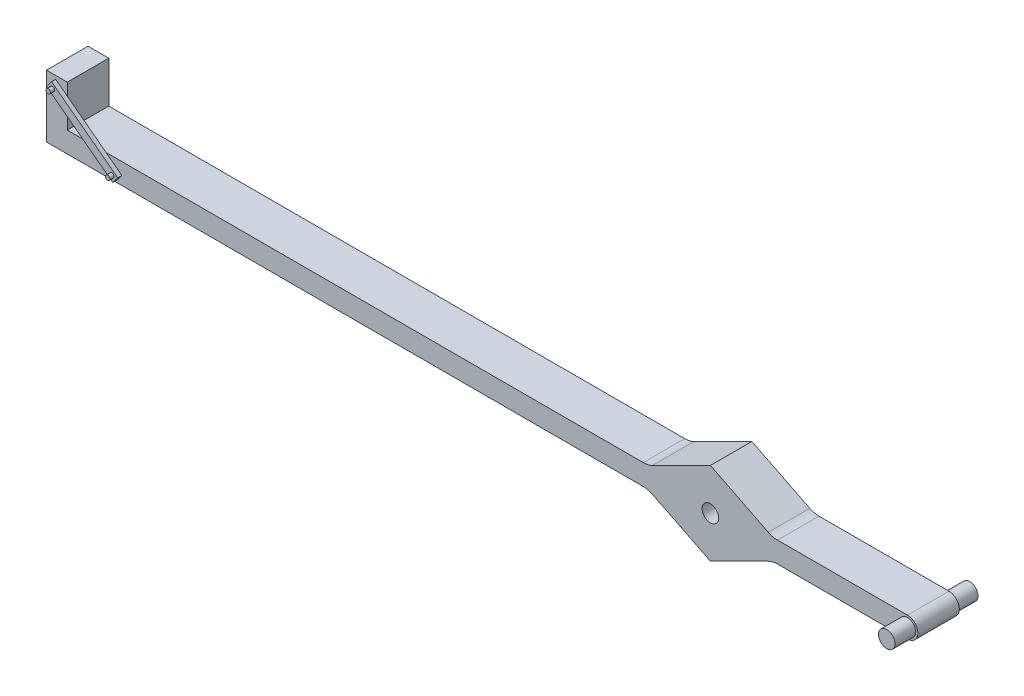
from build123d import *

# Parameters (mm, degrees)
SKETCH1_R           = 2
EXTRUDE1_DEPTH      = 5
FILLET1_R           = 5
FILLET2_RADIUS      = 2.5
FILLET2_LENGTH      = 10
EXTRUDE3_DEPTH      = 5
EXTRUDE3_DEPTH_BACK = 15
SKETCH2_R           = 2
SKETCH3_W           = 5
SKETCH3_H           = 10
EXTRUDE4_DEPTH      = 10
SKETCH4_R           = 0.535102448
EXTRUDE5_DEPTH      = 1
EXTRUDE6_DEPTH      = 2


with BuildPart() as part:
    # Sketch1 → Extrude1 (new, symmetric)
    with BuildSketch(Plane.XY):
        Polygon((-160, 2.5), (-15, 2.5), (0, 10), (15, 2.5), (50, 2.5), (50, -2.5), (15, -2.5), (0, -10), (-15, -2.5), (-160, -2.5), align=None)
        Circle(SKETCH1_R, mode=Mode.SUBTRACT)
    extrude(amount=EXTRUDE1_DEPTH, both=True)

    # Fillet1
    fillet1_edges = [part.edges().sort_by_distance(p)[0] for p in [
        (-15, 2.5, 0),
        (15, 2.5, 0),
        (15, -2.5, 0),
        (-15, -2.5, 0),
    ]]
    fillet(fillet1_edges, radius=FILLET1_R)

    # Fillet2: full round fillet: the end face becomes a half cylinder, R = half its width
    fillet2_face = Plane((50, 0, 0), x_dir=(0, 0, 1), z_dir=(1, 0, 0))  # on the end face: x along it, z out of the body
    fillet2_slab = fillet2_face.offset(-FILLET2_RADIUS / 2) * Box(FILLET2_LENGTH, 2 * FILLET2_RADIUS, FILLET2_RADIUS, mode=Mode.PRIVATE)  # the body's end, R deep
    fillet2_round = Plane((47.5, 0, 0), x_dir=(1, 0, 0), z_dir=(0, 0, 1)) * Cylinder(FILLET2_RADIUS, FILLET2_LENGTH, mode=Mode.PRIVATE)  # its axis R under the face
    add(fillet2_slab - fillet2_round, mode=Mode.SUBTRACT)

    # Sketch2 → Extrude3 (add, two sides: drawn at the far end of the back side and taken through both)
    with BuildSketch(Plane.XY.offset(5).offset(-EXTRUDE3_DEPTH_BACK)):
        with Locations((47.5, 0)):
            Circle(SKETCH2_R)
    extrude(amount=EXTRUDE3_DEPTH + EXTRUDE3_DEPTH_BACK)



with BuildPart() as body_2:
    # Sketch3 → Extrude4 (new body)
    with BuildSketch(Plane(origin=(0, 0, -5), x_dir=(-1, 0, 0), z_dir=(0, 0, -1))):
        with Locations((157.5, 7.5)):
            Rectangle(SKETCH3_W, SKETCH3_H)
    extrude(amount=-EXTRUDE4_DEPTH)


with BuildPart() as part_1:
    add(part.part)

    add(body_2.part)  # Extrude5 merges body 2
    # Sketch4 → Extrude5 (add)
    with BuildSketch(Plane.XY.offset(5)):
        Polygon((-157.784081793, 11.693678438), (-141.847387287, -0.390268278), (-143.055781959, -1.983937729), (-158.992476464, 10.100008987), align=None)
        with Locations((-157.591444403, 10.292646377)):
            Circle(SKETCH4_R, mode=Mode.SUBTRACT)
        with Locations((-143.248419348, -0.582905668)):
            Circle(SKETCH4_R, mode=Mode.SUBTRACT)
    extrude(amount=EXTRUDE5_DEPTH)

    # Sketch4_2 → Extrude6 (add)
    with BuildSketch(Plane.XY.offset(5)):
        with BuildLine():
            ThreePointArc((-157.056341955, 10.292646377), (-157.420896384, 10.799842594), (-158.017832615, 10.61595385))
            Line((-158.017832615, 10.61595385), (-157.165056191, 9.969338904))
            ThreePointArc((-157.165056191, 9.969338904), (-157.084248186, 10.122098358), (-157.056341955, 10.292646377))
        make_face()
        with BuildLine():
            Line((-157.165056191, 9.969338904), (-158.017832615, 10.61595385))
            ThreePointArc((-158.017832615, 10.61595385), (-157.914751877, 9.866258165), (-157.165056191, 9.969338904))
        make_face()
        with BuildLine():
            ThreePointArc((-157.056341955, 10.292646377), (-157.420896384, 10.799842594), (-158.017832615, 10.61595385))
            Line((-158.017832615, 10.61595385), (-157.165056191, 9.969338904))
            ThreePointArc((-157.165056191, 9.969338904), (-157.084248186, 10.122098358), (-157.056341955, 10.292646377))
        make_face()
        with BuildLine():
            Line((-157.165056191, 9.969338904), (-158.017832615, 10.61595385))
            ThreePointArc((-158.017832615, 10.61595385), (-157.914751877, 9.866258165), (-157.165056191, 9.969338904))
        make_face()
        with BuildLine():
            ThreePointArc((-143.67480756, -0.259598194), (-143.571726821, -1.009293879), (-142.822031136, -0.906213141))
            Line((-142.822031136, -0.906213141), (-143.67480756, -0.259598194))
        make_face()
        with BuildLine():
            Line((-143.67480756, -0.259598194), (-142.822031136, -0.906213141))
            ThreePointArc((-142.822031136, -0.906213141), (-142.741223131, -0.753453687), (-142.7133169, -0.582905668))
            ThreePointArc((-142.7133169, -0.582905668), (-143.077871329, -0.07570945), (-143.67480756, -0.259598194))
        make_face()
        with BuildLine():
            ThreePointArc((-143.67480756, -0.259598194), (-143.571726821, -1.009293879), (-142.822031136, -0.906213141))
            Line((-142.822031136, -0.906213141), (-143.67480756, -0.259598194))
        make_face()
        with BuildLine():
            Line((-143.67480756, -0.259598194), (-142.822031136, -0.906213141))
            ThreePointArc((-142.822031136, -0.906213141), (-142.741223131, -0.753453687), (-142.7133169, -0.582905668))
            ThreePointArc((-142.7133169, -0.582905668), (-143.077871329, -0.07570945), (-143.67480756, -0.259598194))
        make_face()
    extrude(amount=EXTRUDE6_DEPTH)


solid = part_1.part
